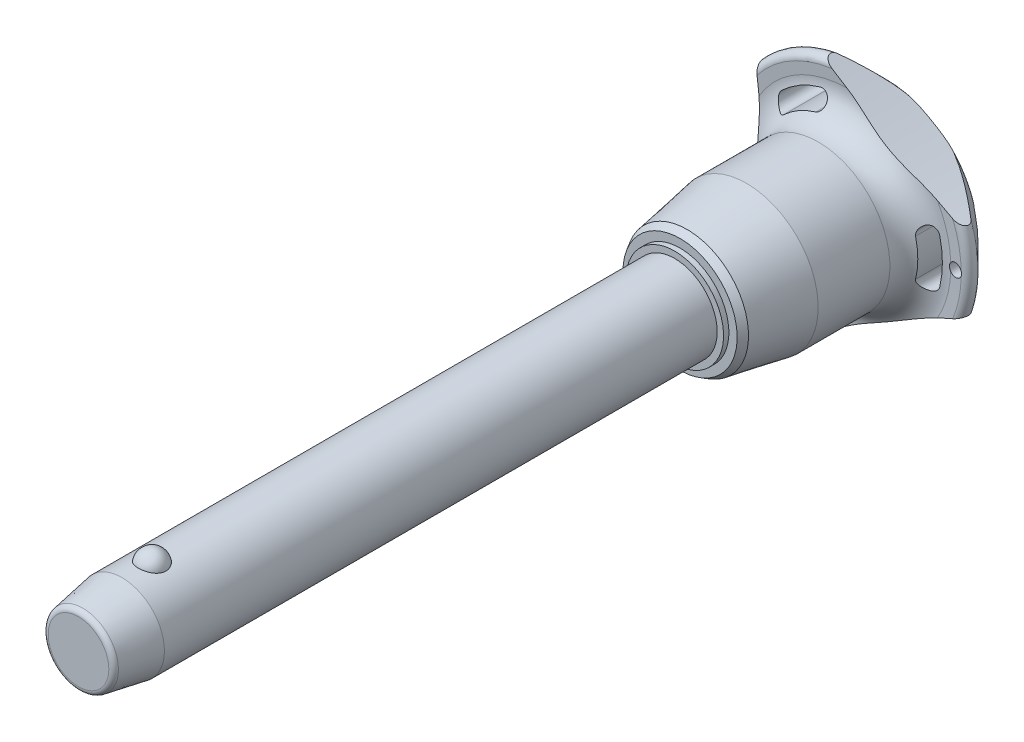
from build123d import *

# Parameters (mm, degrees)
SKETCH1_R           = 10
BOSS_EXTRUDE1_DEPTH = 120
SKETCH2_R           = 8.75
BOSS_EXTRUDE2_DEPTH = 50.7
BOSS_EXTRUDE3_START = 20.5
SKETCH1_2_R         = 10
BOSS_EXTRUDE3_DEPTH = 20.5
CHAMFER1_SIZE       = 10.25
CHAMFER1_SIZE2      = 1.807351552
FILLET1_R           = 1.25
SKETCH6_R           = 176.92625
CUT_EXTRUDE1_DEPTH  = 176.410549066
CIRPATTERN1_COUNT   = 3
SKETCH7_R           = 1.5
CUT_EXTRUDE2_DEPTH  = 176.323744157


with BuildPart() as part:
    # Sketch1 → Boss-Extrude1 (new body)
    with BuildSketch(Plane.XY):
        Circle(SKETCH1_R)
    extrude(amount=-BOSS_EXTRUDE1_DEPTH)

    # Sketch2 → Boss-Extrude2 (add)
    with BuildSketch(Plane(origin=(0, 0, -120), x_dir=(-1, 0, 0), z_dir=(0, 0, -1))):
        with Locations(Location((0, 0, 0), (0, 0, 180))):
            Circle(SKETCH2_R)
    extrude(amount=BOSS_EXTRUDE2_DEPTH)

    # Sketch3 → Revolve1 (revolve)
    with BuildSketch(Plane(origin=(0, 0, 0), x_dir=(0, 0, -1), z_dir=(1, 0, 0))):
        with BuildLine():
            Line((-3.201562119, 12.5), (-3.201562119, 5.9))
            ThreePointArc((-3.201562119, 5.9), (0.098437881, 9.2), (-3.201562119, 12.5))
        make_face()
        with BuildLine():
            Line((-3.201562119, -5.9), (-3.201562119, -12.5))
            ThreePointArc((-3.201562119, -12.5), (0.098437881, -9.2), (-3.201562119, -5.9))
        make_face()
    revolve(axis=Axis((0, -5.9, 3.201562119), (0, 1, 0)))

    # Sketch1_2 → Boss-Extrude3 (add)
    with BuildSketch(Plane.XY.offset(BOSS_EXTRUDE3_START)):
        Circle(SKETCH1_2_R)
    extrude(amount=-BOSS_EXTRUDE3_DEPTH)

    # Chamfer1
    chamfer1_edges = [part.edges().sort_by_distance(p)[0] for p in [
        (-10, 0, 20.5),
    ]]
    chamfer1_side = [part.faces().sort_by_distance(p)[0] for p in [
        (-10, 0, -49.75),
    ]]
    chamfer(chamfer1_edges, length=CHAMFER1_SIZE, length2=CHAMFER1_SIZE2, reference=chamfer1_side[0])

    # Fillet1
    fillet1_edges = [part.edges().sort_by_distance(p)[0] for p in [
        (-8.192648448, 0, 20.5),
        (-8.75, 0, -170.7),
    ]]
    fillet(fillet1_edges, radius=FILLET1_R)

    # Sketch4 → Revolve2 (revolve)
    with BuildSketch(Plane(origin=(0, 0, 0), x_dir=(0, 0, -1), z_dir=(1, 0, 0)), mode=Mode.PRIVATE) as revolve2_sk:
        Polygon((120, 0), (120, 11.504815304), (121.25, 11.504815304), (121.25, 13.461079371), (122.944174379, 14.439211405), (136.9, 16.9), (153.8, 16.9), (153.8, 0), align=None)
    revolve(revolve2_sk.sketch.rotate(Axis((0, 0, -153.8), (0, 0, 1)), 90), axis=Axis((0, 0, -153.8), (0, 0, 1)))

    # Sketch5 → Revolve3 (revolve)
    with BuildSketch(Plane(origin=(0, 0, 0), x_dir=(0, 0, -1), z_dir=(1, 0, 0)), mode=Mode.PRIVATE) as revolve3_sk:
        with BuildLine():
            Line((160.790129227, 24.271609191), (160.652256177, 26.865060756))
            ThreePointArc((160.652256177, 26.865060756), (161.598671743, 28.411427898), (163.38137085, 28.08137085))
            Line((163.38137085, 28.08137085), (169.763226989, 21.69951471))
            ThreePointArc((169.763226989, 21.69951471), (170.7, 19.381044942), (169.683055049, 17.096604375))
            ThreePointArc((169.683055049, 17.096604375), (164.18864484, 9.321268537), (162.25, 0))
            Line((162.25, 0), (153.8, 0))
            Line((153.8, 0), (153.8, 16.9))
            ThreePointArc((153.8, 16.9), (158.879432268, 19.083427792), (160.790129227, 24.271609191))
        make_face()
    revolve(revolve3_sk.sketch.rotate(Axis((0, 0, -162.25), (0, 0, 1)), 90), axis=Axis((0, 0, -162.25), (0, 0, 1)))

    # Sketch6 → Cut-Extrude1 (cut, through all)
    with BuildSketch(Plane.XY):
        with Locations((-197.42625, 0)):
            Circle(SKETCH6_R)
        with BuildLine():
            ThreePointArc((21.802992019, -5.260839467), (22.428706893, 0), (21.802992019, 5.260839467))
            ThreePointArc((21.802992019, 5.260839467), (19.579234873, 6.620060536), (18.220013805, 4.39630339))
            ThreePointArc((18.220013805, 4.39630339), (18.742902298, 0), (18.220013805, -4.39630339))
            ThreePointArc((18.220013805, -4.39630339), (19.579234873, -6.620060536), (21.802992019, -5.260839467))
        make_face()
    cut_extrude1 = extrude(amount=-CUT_EXTRUDE1_DEPTH, mode=Mode.SUBTRACT)

    # CirPattern1: Cut-Extrude1 ×3 about axis
    cirpattern1_axis = Axis((0, 0, 0), (0, 0, 1))
    for i in range(1, CIRPATTERN1_COUNT):
        add(cut_extrude1.rotate(cirpattern1_axis, i * 360 / CIRPATTERN1_COUNT), mode=Mode.SUBTRACT)

    # Sketch7 → Cut-Extrude2 (cut, through all)
    with BuildSketch(Plane.XY):
        with Locations(Location((25.428706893, 0, 0), (0, 0, 17.230769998))):
            Circle(SKETCH7_R)
    extrude(amount=-CUT_EXTRUDE2_DEPTH, mode=Mode.SUBTRACT)


solid = part.part
